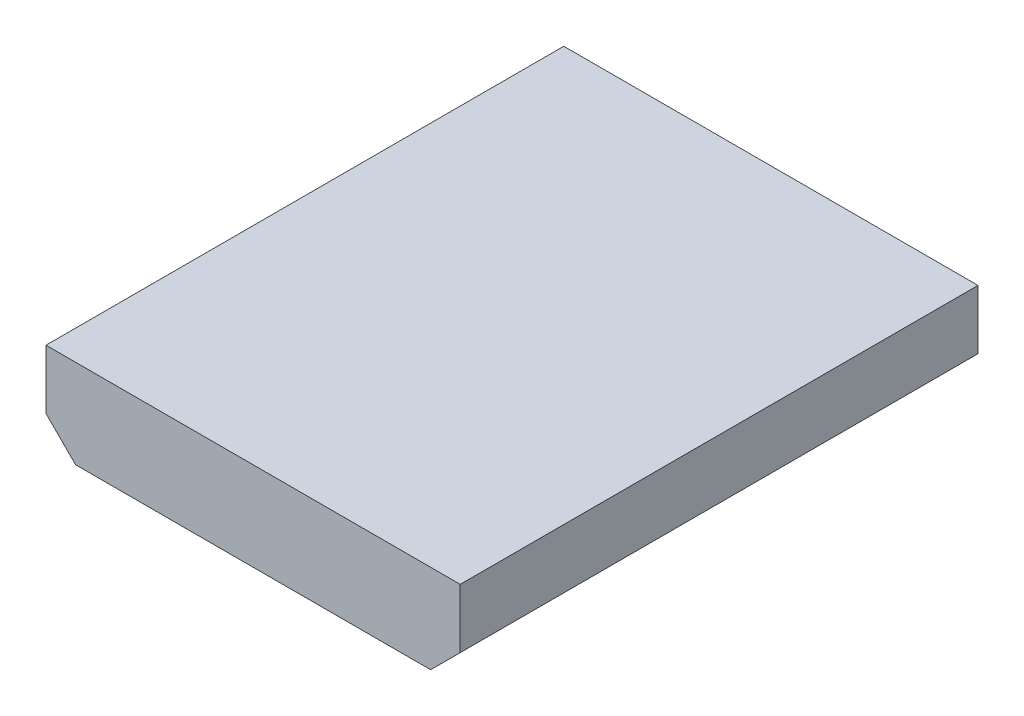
from build123d import *

# Parameters (mm, degrees)
BOSS_EXTRUDE1_DEPTH = 8.75


with BuildPart() as part:
    # Sketch1 → Boss-Extrude1 (new, symmetric)
    with BuildSketch(Plane.XY):
        Polygon((6, 0), (-6, 0), (-7, 0), (-7, -2), (-6, -3), (6, -3), (7, -2), (7, 0), align=None)
    extrude(amount=BOSS_EXTRUDE1_DEPTH, both=True)


solid = part.part
